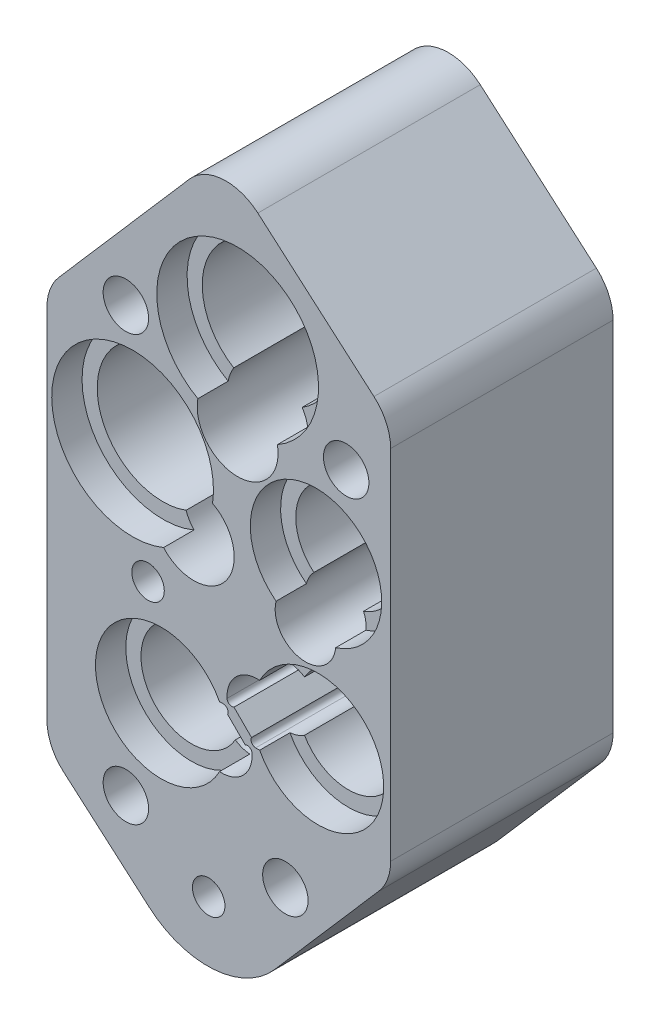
from build123d import *

# Parameters (mm, degrees)
BOSS_EXTRUDE1_DEPTH      = 3.175
BOSS_EXTRUDE1_DEPTH_BACK = 31.75
HOLE1_D                  = 9.525
HOLE11_D                 = 9.525
HOLE12_D                 = 12.7
HOLE13_D                 = 12.7
HOLE14_D                 = 15.875
HOLE14_CBORE_D           = 20.6375
HOLE14_CBORE_DEPTH       = 4.7625
HOLE15_D                 = 20.6375
HOLE15_CBORE_D           = 25.4
HOLE15_CBORE_DEPTH       = 4.7625
HOLE16_D                 = 7.1374
HOLE16_CBORE_D           = 10.7188
HOLE16_CBORE_DEPTH       = 14.224
BOSS_EXTRUDE2_START      = -34.925
BOSS_EXTRUDE2_DEPTH      = 34.925
HOLE17_D                 = 5.1054
HOLE17_DEPTH             = 34.925
HOLE17_TIP               = 1.533816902


with BuildPart() as part:
    # Sketch1 → Boss-Extrude1 (new, two sides: drawn at the far end of the back side and taken through both)
    with BuildSketch(Plane(origin=(0, 0, 40.2082), x_dir=(-1, 0, 0), z_dir=(0, 0, -1)).offset(-BOSS_EXTRUDE1_DEPTH_BACK)):
        with BuildLine():
            Line((778.466641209, 11.143660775), (796.698391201, 26.976643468))
            ThreePointArc((796.698391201, 26.976643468), (802.230009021, 28.824491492), (807.448079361, 26.219672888))
            Line((807.448079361, 26.219672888), (827.95132937, 2.610089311))
            ThreePointArc((827.95132937, 2.610089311), (829.336093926, 0.28056668), (829.818, -2.38626948))
            Line((829.818, -2.38626948), (829.818, -58.530090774))
            ThreePointArc((829.818, -58.530090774), (829.131132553, -61.691747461), (827.194358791, -64.283420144))
            Line((827.194358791, -64.283420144), (813.75704994, -75.952770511))
            ThreePointArc((813.75704994, -75.952770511), (803.615750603, -79.340491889), (794.049288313, -74.564991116))
            Line((794.049288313, -74.564991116), (777.70967063, -55.74984868))
            ThreePointArc((777.70967063, -55.74984868), (776.324906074, -53.420326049), (775.843, -50.753489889))
            Line((775.843, -50.753489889), (775.843, 5.390331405))
            ThreePointArc((775.843, 5.390331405), (776.529867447, 8.551988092), (778.466641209, 11.143660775))
        make_face()
    extrude(amount=BOSS_EXTRUDE1_DEPTH + BOSS_EXTRUDE1_DEPTH_BACK)

    # Hole1 (through all)
    with Locations(Plane(origin=(-806.009042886, -36.640114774, 71.9582), x_dir=(1, 0, 0), z_dir=(0, 0, 1))):
        with Locations((3.654260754, -10.601140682), (9.231042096, -4.536872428)):
            Hole(HOLE1_D / 2)

    # Hole11 (through all)
    with Locations(Plane(origin=(-792.875039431, -14.952072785, 71.9582), x_dir=(1, 0, 0), z_dir=(0, 0, 1))):
        with Locations((3.654260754, -10.601140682)):
            Hole(HOLE11_D / 2)

    # Hole12 (through all)
    with Locations(Plane(origin=(-810.41464965, -11.084921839, 71.9582), x_dir=(1, 0, 0), z_dir=(0, 0, 1))):
        with Locations((3.654260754, -10.601140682)):
            Hole(HOLE12_D / 2)

    # Hole13 (through all)
    with Locations(Plane(origin=(-812.742253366, -3.174713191, 71.9582), x_dir=(1, 0, 0), z_dir=(0, 0, 1))):
        with Locations((12.869107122, -0.934999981)):
            Hole(HOLE13_D / 2)

    # Hole14 (through all)
    with Locations(Plane(origin=(-800.122107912, -40.241987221, 71.9582), x_dir=(1, 0, 0), z_dir=(0, 0, 1))):
        with Locations((12.869107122, -0.934999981), (-11.75767422, -6.999268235), (12.555328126, 24.069067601)):
            CounterBoreHole(HOLE14_D / 2, HOLE14_CBORE_D / 2, HOLE14_CBORE_DEPTH)

    # Hole15 (through all)
    with Locations(Plane(origin=(-812.742253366, 9.017286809, 71.9582), x_dir=(1, 0, 0), z_dir=(0, 0, 1))):
        with Locations((12.869107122, -0.934999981), (-3.625562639, -23.197204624)):
            CounterBoreHole(HOLE15_D / 2, HOLE15_CBORE_D / 2, HOLE15_CBORE_DEPTH)

    # Hole16 (through all)
    with Locations(Plane(origin=(-771.228892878, 0.376743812, 37.0332), x_dir=(-1, 0, 0), z_dir=(0, 0, -1))):
        with Locations((11.599107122, -1.378429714), (46.196100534, 3.701570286), (21.149268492, -62.973429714), (46.196100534, -62.973429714)):
            CounterBoreHole(HOLE16_D / 2, HOLE16_CBORE_D / 2, HOLE16_CBORE_DEPTH)

    # Sketch3 → Boss-Extrude2 (add)
    with BuildSketch(Plane.XY.offset(71.9582).offset(BOSS_EXTRUDE2_START)):
        with BuildLine():
            Line((-800.443680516, -42.091238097), (-797.692251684, -44.842666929))
            ThreePointArc((-797.692251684, -44.842666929), (-797.660452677, -45.559085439), (-797.047817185, -45.931837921))
            ThreePointArc((-797.047817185, -45.931837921), (-797.429583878, -45.894703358), (-797.807124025, -45.826966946))
            ThreePointArc((-797.807124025, -45.826966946), (-797.668459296, -46.392854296), (-797.599931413, -46.97143906))
            ThreePointArc((-797.599931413, -46.97143906), (-797.972683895, -46.358803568), (-798.689102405, -46.327004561))
            Line((-798.689102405, -46.327004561), (-801.440531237, -43.57557573))
            ThreePointArc((-801.440531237, -43.57557573), (-801.472330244, -42.859157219), (-802.084965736, -42.486404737))
            ThreePointArc((-802.084965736, -42.486404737), (-801.703199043, -42.5235393), (-801.325658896, -42.591275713))
            ThreePointArc((-801.325658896, -42.591275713), (-801.464323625, -42.025388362), (-801.532851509, -41.446803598))
            ThreePointArc((-801.532851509, -41.446803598), (-801.160099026, -42.05943909), (-800.443680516, -42.091238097))
        make_face()
    extrude(amount=BOSS_EXTRUDE2_DEPTH)

    # Hole17
    with Locations(Plane(origin=(-818.631455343, -60.678626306, 71.9582), x_dir=(1, 0, 0), z_dir=(0, 0, 1))):
        with Locations((14.213455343, -9.167765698), (4.688455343, 28.928626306)):
            Hole(HOLE17_D / 2, depth=HOLE17_DEPTH)
            with Locations((0, 0, -(HOLE17_DEPTH + HOLE17_TIP / 2))):  # 118° drill point
                Cone(0, HOLE17_D / 2, HOLE17_TIP, mode=Mode.SUBTRACT)


solid = part.part
